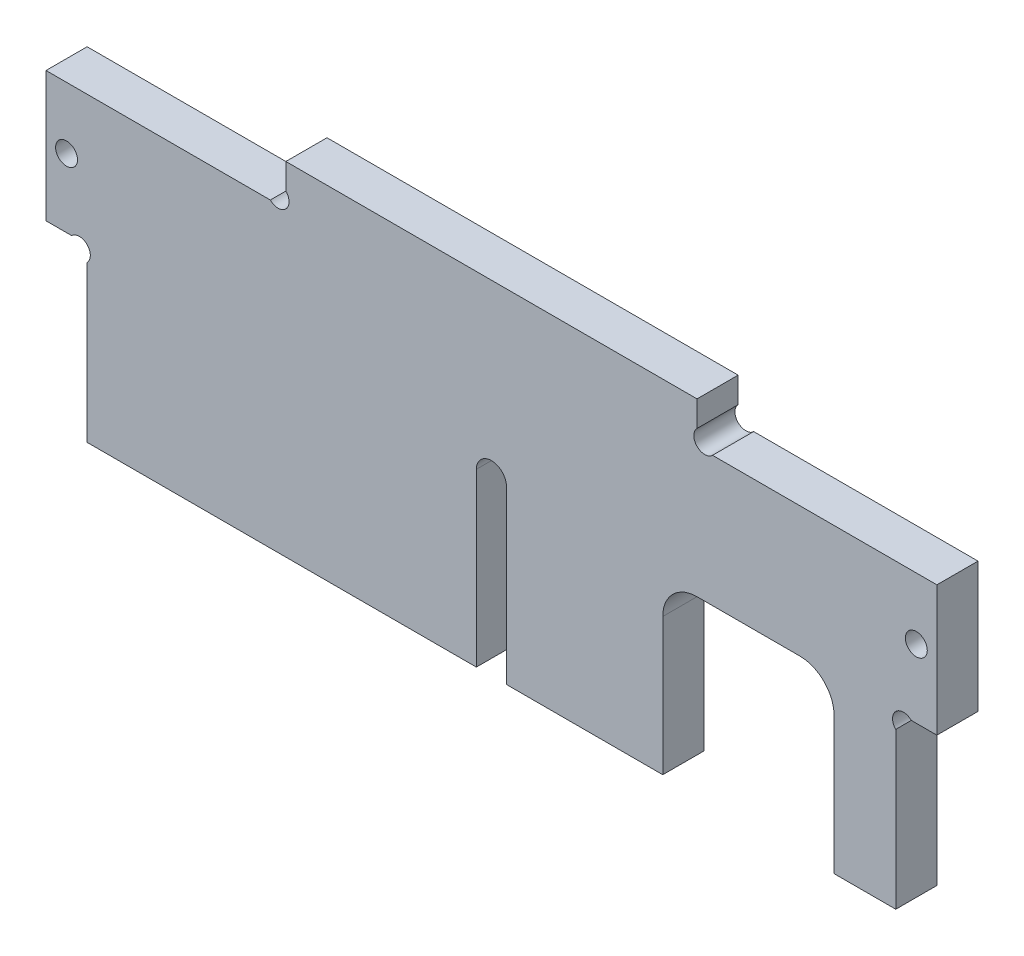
ISO-10303-21;
HEADER;
FILE_DESCRIPTION(('STEP AP214'),'2;1');
FILE_NAME('part.step','',(''),(''),'','','');
FILE_SCHEMA(('AUTOMOTIVE_DESIGN { 1 0 10303 214 1 1 1 1 }'));
ENDSEC;
DATA;
#1=APPLICATION_CONTEXT('core data for automotive mechanical design processes');
#2=APPLICATION_PROTOCOL_DEFINITION('international standard','automotive_design',2000,#1);
#3=PRODUCT_CONTEXT('',#1,'mechanical');
#4=PRODUCT('Part','Part','',(#3));
#5=PRODUCT_RELATED_PRODUCT_CATEGORY('part','',(#4));
#6=PRODUCT_DEFINITION_FORMATION('','',#4);
#7=PRODUCT_DEFINITION_CONTEXT('part definition',#1,'design');
#8=PRODUCT_DEFINITION('design','',#6,#7);
#9=PRODUCT_DEFINITION_SHAPE('','',#8);
#10=(LENGTH_UNIT() NAMED_UNIT(*) SI_UNIT(.MILLI.,.METRE.));
#11=(NAMED_UNIT(*) PLANE_ANGLE_UNIT() SI_UNIT($,.RADIAN.));
#12=(NAMED_UNIT(*) SI_UNIT($,.STERADIAN.) SOLID_ANGLE_UNIT());
#13=UNCERTAINTY_MEASURE_WITH_UNIT(LENGTH_MEASURE(1.E-05),#10,'distance_accuracy_value','');
#14=(GEOMETRIC_REPRESENTATION_CONTEXT(3) GLOBAL_UNCERTAINTY_ASSIGNED_CONTEXT((#13)) GLOBAL_UNIT_ASSIGNED_CONTEXT((#10,
#11,#12)) REPRESENTATION_CONTEXT('',''));
#15=CARTESIAN_POINT('',(0.,0.,0.));
#16=DIRECTION('',(0.,0.,1.));
#17=DIRECTION('',(1.,0.,0.));
#18=AXIS2_PLACEMENT_3D('',#15,#16,#17);
#19=CARTESIAN_POINT('',(31.1313708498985,45.1313708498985,6.));
#20=DIRECTION('',(0.,0.,1.));
#21=DIRECTION('',(1.,0.,0.));
#22=AXIS2_PLACEMENT_3D('',#19,#20,#21);
#23=PLANE('',#22);
#24=CARTESIAN_POINT('',(62.,35.,6.));
#25=DIRECTION('',(0.,0.,1.));
#26=DIRECTION('',(1.,0.,0.));
#27=AXIS2_PLACEMENT_3D('',#24,#25,#26);
#28=CIRCLE('',#27,1.60000000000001);
#29=CARTESIAN_POINT('',(63.6,35.,6.));
#30=VERTEX_POINT('',#29);
#31=EDGE_CURVE('E246',#30,#30,#28,.T.);
#32=ORIENTED_EDGE('',*,*,#31,.F.);
#33=EDGE_LOOP('',(#32));
#34=FACE_BOUND('',#33,.T.);
#35=CARTESIAN_POINT('',(31.1313708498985,45.1313708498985,6.));
#36=DIRECTION('',(0.,0.,-1.));
#37=DIRECTION('',(1.,0.,0.));
#38=AXIS2_PLACEMENT_3D('',#35,#36,#37);
#39=CIRCLE('',#38,1.6);
#40=CARTESIAN_POINT('',(32.2627416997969,44.,6.));
#41=VERTEX_POINT('',#40);
#42=CARTESIAN_POINT('',(30.,46.262741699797,6.));
#43=VERTEX_POINT('',#42);
#44=EDGE_CURVE('E293',#41,#43,#39,.T.);
#45=ORIENTED_EDGE('',*,*,#44,.T.);
#46=DIRECTION('',(0.,1.,0.));
#47=VECTOR('',#46,1.);
#48=CARTESIAN_POINT('',(30.,46.262741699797,6.));
#49=LINE('',#48,#47);
#50=CARTESIAN_POINT('',(30.,50.,6.));
#51=VERTEX_POINT('',#50);
#52=EDGE_CURVE('E151',#43,#51,#49,.T.);
#53=ORIENTED_EDGE('',*,*,#52,.T.);
#54=DIRECTION('',(-1.,0.,0.));
#55=VECTOR('',#54,1.);
#56=CARTESIAN_POINT('',(-30.,50.,6.));
#57=LINE('',#56,#55);
#58=CARTESIAN_POINT('',(-30.,50.,6.));
#59=VERTEX_POINT('',#58);
#60=EDGE_CURVE('E362',#51,#59,#57,.T.);
#61=ORIENTED_EDGE('',*,*,#60,.T.);
#62=DIRECTION('',(0.,-1.,0.));
#63=VECTOR('',#62,1.);
#64=CARTESIAN_POINT('',(-30.,46.2627416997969,6.));
#65=LINE('',#64,#63);
#66=CARTESIAN_POINT('',(-30.,46.2627416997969,6.));
#67=VERTEX_POINT('',#66);
#68=EDGE_CURVE('E381',#59,#67,#65,.T.);
#69=ORIENTED_EDGE('',*,*,#68,.T.);
#70=CARTESIAN_POINT('',(-31.1313708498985,45.1313708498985,6.));
#71=DIRECTION('',(0.,0.,-1.));
#72=DIRECTION('',(-1.,0.,0.));
#73=AXIS2_PLACEMENT_3D('',#70,#71,#72);
#74=CIRCLE('',#73,1.59999999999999);
#75=CARTESIAN_POINT('',(-32.2627416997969,44.,6.));
#76=VERTEX_POINT('',#75);
#77=EDGE_CURVE('E378',#67,#76,#74,.T.);
#78=ORIENTED_EDGE('',*,*,#77,.T.);
#79=DIRECTION('',(-1.,0.,0.));
#80=VECTOR('',#79,1.);
#81=CARTESIAN_POINT('',(-32.2627416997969,44.,6.));
#82=LINE('',#81,#80);
#83=CARTESIAN_POINT('',(-65.,44.,6.));
#84=VERTEX_POINT('',#83);
#85=EDGE_CURVE('E380',#76,#84,#82,.T.);
#86=ORIENTED_EDGE('',*,*,#85,.T.);
#87=DIRECTION('',(0.,-1.,0.));
#88=VECTOR('',#87,1.);
#89=CARTESIAN_POINT('',(-65.,44.,6.));
#90=LINE('',#89,#88);
#91=CARTESIAN_POINT('',(-65.,25.,6.));
#92=VERTEX_POINT('',#91);
#93=EDGE_CURVE('E383',#84,#92,#90,.T.);
#94=ORIENTED_EDGE('',*,*,#93,.T.);
#95=DIRECTION('',(1.,0.,0.));
#96=VECTOR('',#95,1.);
#97=CARTESIAN_POINT('',(-65.,25.,6.));
#98=LINE('',#97,#96);
#99=CARTESIAN_POINT('',(-61.262741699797,25.,6.));
#100=VERTEX_POINT('',#99);
#101=EDGE_CURVE('E389',#92,#100,#98,.T.);
#102=ORIENTED_EDGE('',*,*,#101,.T.);
#103=CARTESIAN_POINT('',(-60.1313708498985,23.8686291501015,6.));
#104=DIRECTION('',(0.,0.,-1.));
#105=DIRECTION('',(-1.,0.,0.));
#106=AXIS2_PLACEMENT_3D('',#103,#104,#105);
#107=CIRCLE('',#106,1.60000000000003);
#108=CARTESIAN_POINT('',(-59.,22.737258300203,6.));
#109=VERTEX_POINT('',#108);
#110=EDGE_CURVE('E391',#100,#109,#107,.T.);
#111=ORIENTED_EDGE('',*,*,#110,.T.);
#112=DIRECTION('',(0.,-1.,0.));
#113=VECTOR('',#112,1.);
#114=CARTESIAN_POINT('',(-59.,22.737258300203,6.));
#115=LINE('',#114,#113);
#116=CARTESIAN_POINT('',(-59.,0.,6.));
#117=VERTEX_POINT('',#116);
#118=EDGE_CURVE('E393',#109,#117,#115,.T.);
#119=ORIENTED_EDGE('',*,*,#118,.T.);
#120=DIRECTION('',(1.,0.,0.));
#121=VECTOR('',#120,1.);
#122=CARTESIAN_POINT('',(-59.,0.,6.));
#123=LINE('',#122,#121);
#124=CARTESIAN_POINT('',(-2.2,0.,6.));
#125=VERTEX_POINT('',#124);
#126=EDGE_CURVE('E395',#117,#125,#123,.T.);
#127=ORIENTED_EDGE('',*,*,#126,.T.);
#128=DIRECTION('',(0.,1.,0.));
#129=VECTOR('',#128,1.);
#130=CARTESIAN_POINT('',(-2.2,25.,6.));
#131=LINE('',#130,#129);
#132=CARTESIAN_POINT('',(-2.2,25.,6.));
#133=VERTEX_POINT('',#132);
#134=EDGE_CURVE('E397',#125,#133,#131,.T.);
#135=ORIENTED_EDGE('',*,*,#134,.T.);
#136=CARTESIAN_POINT('',(0.,25.,6.));
#137=DIRECTION('',(0.,0.,-1.));
#138=DIRECTION('',(1.,0.,0.));
#139=AXIS2_PLACEMENT_3D('',#136,#137,#138);
#140=CIRCLE('',#139,2.2);
#141=CARTESIAN_POINT('',(2.2,25.,6.));
#142=VERTEX_POINT('',#141);
#143=EDGE_CURVE('E399',#133,#142,#140,.T.);
#144=ORIENTED_EDGE('',*,*,#143,.T.);
#145=DIRECTION('',(0.,-1.,0.));
#146=VECTOR('',#145,1.);
#147=CARTESIAN_POINT('',(2.2,25.,6.));
#148=LINE('',#147,#146);
#149=CARTESIAN_POINT('',(2.2,0.,6.));
#150=VERTEX_POINT('',#149);
#151=EDGE_CURVE('E401',#142,#150,#148,.T.);
#152=ORIENTED_EDGE('',*,*,#151,.T.);
#153=DIRECTION('',(1.,0.,0.));
#154=VECTOR('',#153,1.);
#155=CARTESIAN_POINT('',(2.2,0.,6.));
#156=LINE('',#155,#154);
#157=CARTESIAN_POINT('',(25.,0.,6.));
#158=VERTEX_POINT('',#157);
#159=EDGE_CURVE('E403',#150,#158,#156,.T.);
#160=ORIENTED_EDGE('',*,*,#159,.T.);
#161=DIRECTION('',(0.,1.,0.));
#162=VECTOR('',#161,1.);
#163=CARTESIAN_POINT('',(25.,20.,6.));
#164=LINE('',#163,#162);
#165=CARTESIAN_POINT('',(25.,20.,6.));
#166=VERTEX_POINT('',#165);
#167=EDGE_CURVE('E405',#158,#166,#164,.T.);
#168=ORIENTED_EDGE('',*,*,#167,.T.);
#169=CARTESIAN_POINT('',(30.,20.,6.));
#170=DIRECTION('',(0.,0.,-1.));
#171=DIRECTION('',(1.,0.,0.));
#172=AXIS2_PLACEMENT_3D('',#169,#170,#171);
#173=CIRCLE('',#172,5.);
#174=CARTESIAN_POINT('',(30.,25.,6.));
#175=VERTEX_POINT('',#174);
#176=EDGE_CURVE('E407',#166,#175,#173,.T.);
#177=ORIENTED_EDGE('',*,*,#176,.T.);
#178=DIRECTION('',(1.,0.,0.));
#179=VECTOR('',#178,1.);
#180=CARTESIAN_POINT('',(45.,25.,6.));
#181=LINE('',#180,#179);
#182=CARTESIAN_POINT('',(45.,25.,6.));
#183=VERTEX_POINT('',#182);
#184=EDGE_CURVE('E409',#175,#183,#181,.T.);
#185=ORIENTED_EDGE('',*,*,#184,.T.);
#186=CARTESIAN_POINT('',(45.,20.,6.));
#187=DIRECTION('',(0.,0.,-1.));
#188=DIRECTION('',(1.,0.,0.));
#189=AXIS2_PLACEMENT_3D('',#186,#187,#188);
#190=CIRCLE('',#189,5.);
#191=CARTESIAN_POINT('',(50.,20.,6.));
#192=VERTEX_POINT('',#191);
#193=EDGE_CURVE('E411',#183,#192,#190,.T.);
#194=ORIENTED_EDGE('',*,*,#193,.T.);
#195=DIRECTION('',(0.,-1.,0.));
#196=VECTOR('',#195,1.);
#197=CARTESIAN_POINT('',(50.,0.,6.));
#198=LINE('',#197,#196);
#199=CARTESIAN_POINT('',(50.,0.,6.));
#200=VERTEX_POINT('',#199);
#201=EDGE_CURVE('E413',#192,#200,#198,.T.);
#202=ORIENTED_EDGE('',*,*,#201,.T.);
#203=DIRECTION('',(1.,0.,0.));
#204=VECTOR('',#203,1.);
#205=CARTESIAN_POINT('',(50.,0.,6.));
#206=LINE('',#205,#204);
#207=CARTESIAN_POINT('',(59.,0.,6.));
#208=VERTEX_POINT('',#207);
#209=EDGE_CURVE('E415',#200,#208,#206,.T.);
#210=ORIENTED_EDGE('',*,*,#209,.T.);
#211=DIRECTION('',(0.,1.,0.));
#212=VECTOR('',#211,1.);
#213=CARTESIAN_POINT('',(59.,22.737258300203,6.));
#214=LINE('',#213,#212);
#215=CARTESIAN_POINT('',(59.,22.737258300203,6.));
#216=VERTEX_POINT('',#215);
#217=EDGE_CURVE('E417',#208,#216,#214,.T.);
#218=ORIENTED_EDGE('',*,*,#217,.T.);
#219=CARTESIAN_POINT('',(60.1313708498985,23.8686291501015,6.));
#220=DIRECTION('',(0.,0.,-1.));
#221=DIRECTION('',(1.,0.,0.));
#222=AXIS2_PLACEMENT_3D('',#219,#220,#221);
#223=CIRCLE('',#222,1.60000000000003);
#224=CARTESIAN_POINT('',(61.262741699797,25.,6.));
#225=VERTEX_POINT('',#224);
#226=EDGE_CURVE('E224',#216,#225,#223,.T.);
#227=ORIENTED_EDGE('',*,*,#226,.T.);
#228=DIRECTION('',(1.,0.,0.));
#229=VECTOR('',#228,1.);
#230=CARTESIAN_POINT('',(65.,25.,6.));
#231=LINE('',#230,#229);
#232=CARTESIAN_POINT('',(65.,25.,6.));
#233=VERTEX_POINT('',#232);
#234=EDGE_CURVE('E218',#225,#233,#231,.T.);
#235=ORIENTED_EDGE('',*,*,#234,.T.);
#236=DIRECTION('',(0.,1.,0.));
#237=VECTOR('',#236,1.);
#238=CARTESIAN_POINT('',(65.,44.,6.));
#239=LINE('',#238,#237);
#240=CARTESIAN_POINT('',(65.,44.,6.));
#241=VERTEX_POINT('',#240);
#242=EDGE_CURVE('E222',#233,#241,#239,.T.);
#243=ORIENTED_EDGE('',*,*,#242,.T.);
#244=DIRECTION('',(-1.,0.,0.));
#245=VECTOR('',#244,1.);
#246=CARTESIAN_POINT('',(32.2627416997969,44.,6.));
#247=LINE('',#246,#245);
#248=EDGE_CURVE('E54',#241,#41,#247,.T.);
#249=ORIENTED_EDGE('',*,*,#248,.T.);
#250=EDGE_LOOP('',(#45,#53,#61,#69,#78,#86,#94,#102,#111,#119,#127,#135,#144,#152,#160,#168,
#177,#185,#194,#202,#210,#218,#227,#235,#243,#249));
#251=FACE_BOUND('',#250,.T.);
#252=CARTESIAN_POINT('',(-62.,35.,6.));
#253=DIRECTION('',(0.,0.,1.));
#254=DIRECTION('',(-1.,0.,0.));
#255=AXIS2_PLACEMENT_3D('',#252,#253,#254);
#256=CIRCLE('',#255,1.6);
#257=CARTESIAN_POINT('',(-63.6,35.,6.));
#258=VERTEX_POINT('',#257);
#259=EDGE_CURVE('E460',#258,#258,#256,.T.);
#260=ORIENTED_EDGE('',*,*,#259,.F.);
#261=EDGE_LOOP('',(#260));
#262=FACE_BOUND('',#261,.T.);
#263=ADVANCED_FACE('F37',(#34,#251,#262),#23,.T.);
#264=CARTESIAN_POINT('',(31.1313708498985,45.1313708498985,0.));
#265=DIRECTION('',(0.,0.,1.));
#266=DIRECTION('',(1.,0.,0.));
#267=AXIS2_PLACEMENT_3D('',#264,#265,#266);
#268=PLANE('',#267);
#269=CARTESIAN_POINT('',(62.,35.,0.));
#270=DIRECTION('',(0.,0.,1.));
#271=DIRECTION('',(1.,0.,0.));
#272=AXIS2_PLACEMENT_3D('',#269,#270,#271);
#273=CIRCLE('',#272,1.60000000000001);
#274=CARTESIAN_POINT('',(63.6,35.,0.));
#275=VERTEX_POINT('',#274);
#276=EDGE_CURVE('E465',#275,#275,#273,.T.);
#277=ORIENTED_EDGE('',*,*,#276,.T.);
#278=EDGE_LOOP('',(#277));
#279=FACE_BOUND('',#278,.T.);
#280=CARTESIAN_POINT('',(31.1313708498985,45.1313708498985,0.));
#281=DIRECTION('',(0.,0.,-1.));
#282=DIRECTION('',(1.,0.,0.));
#283=AXIS2_PLACEMENT_3D('',#280,#281,#282);
#284=CIRCLE('',#283,1.6);
#285=CARTESIAN_POINT('',(32.2627416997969,44.,0.));
#286=VERTEX_POINT('',#285);
#287=CARTESIAN_POINT('',(30.,46.262741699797,0.));
#288=VERTEX_POINT('',#287);
#289=EDGE_CURVE('E242',#286,#288,#284,.T.);
#290=ORIENTED_EDGE('',*,*,#289,.F.);
#291=DIRECTION('',(-1.,0.,0.));
#292=VECTOR('',#291,1.);
#293=CARTESIAN_POINT('',(32.2627416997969,44.,0.));
#294=LINE('',#293,#292);
#295=CARTESIAN_POINT('',(65.,44.,0.));
#296=VERTEX_POINT('',#295);
#297=EDGE_CURVE('E143',#296,#286,#294,.T.);
#298=ORIENTED_EDGE('',*,*,#297,.F.);
#299=DIRECTION('',(0.,1.,0.));
#300=VECTOR('',#299,1.);
#301=CARTESIAN_POINT('',(65.,44.,0.));
#302=LINE('',#301,#300);
#303=CARTESIAN_POINT('',(65.,25.,0.));
#304=VERTEX_POINT('',#303);
#305=EDGE_CURVE('E137',#304,#296,#302,.T.);
#306=ORIENTED_EDGE('',*,*,#305,.F.);
#307=DIRECTION('',(1.,0.,0.));
#308=VECTOR('',#307,1.);
#309=CARTESIAN_POINT('',(65.,25.,0.));
#310=LINE('',#309,#308);
#311=CARTESIAN_POINT('',(61.262741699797,25.,0.));
#312=VERTEX_POINT('',#311);
#313=EDGE_CURVE('E232',#312,#304,#310,.T.);
#314=ORIENTED_EDGE('',*,*,#313,.F.);
#315=CARTESIAN_POINT('',(60.1313708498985,23.8686291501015,0.));
#316=DIRECTION('',(0.,0.,-1.));
#317=DIRECTION('',(1.,0.,0.));
#318=AXIS2_PLACEMENT_3D('',#315,#316,#317);
#319=CIRCLE('',#318,1.60000000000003);
#320=CARTESIAN_POINT('',(59.,22.737258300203,0.));
#321=VERTEX_POINT('',#320);
#322=EDGE_CURVE('E288',#321,#312,#319,.T.);
#323=ORIENTED_EDGE('',*,*,#322,.F.);
#324=DIRECTION('',(0.,1.,0.));
#325=VECTOR('',#324,1.);
#326=CARTESIAN_POINT('',(59.,22.737258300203,0.));
#327=LINE('',#326,#325);
#328=CARTESIAN_POINT('',(59.,0.,0.));
#329=VERTEX_POINT('',#328);
#330=EDGE_CURVE('E286',#329,#321,#327,.T.);
#331=ORIENTED_EDGE('',*,*,#330,.F.);
#332=DIRECTION('',(1.,0.,0.));
#333=VECTOR('',#332,1.);
#334=CARTESIAN_POINT('',(50.,0.,0.));
#335=LINE('',#334,#333);
#336=CARTESIAN_POINT('',(50.,0.,0.));
#337=VERTEX_POINT('',#336);
#338=EDGE_CURVE('E284',#337,#329,#335,.T.);
#339=ORIENTED_EDGE('',*,*,#338,.F.);
#340=DIRECTION('',(0.,-1.,0.));
#341=VECTOR('',#340,1.);
#342=CARTESIAN_POINT('',(50.,0.,0.));
#343=LINE('',#342,#341);
#344=CARTESIAN_POINT('',(50.,20.,0.));
#345=VERTEX_POINT('',#344);
#346=EDGE_CURVE('E282',#345,#337,#343,.T.);
#347=ORIENTED_EDGE('',*,*,#346,.F.);
#348=CARTESIAN_POINT('',(45.,20.,0.));
#349=DIRECTION('',(0.,0.,-1.));
#350=DIRECTION('',(1.,0.,0.));
#351=AXIS2_PLACEMENT_3D('',#348,#349,#350);
#352=CIRCLE('',#351,5.);
#353=CARTESIAN_POINT('',(45.,25.,0.));
#354=VERTEX_POINT('',#353);
#355=EDGE_CURVE('E280',#354,#345,#352,.T.);
#356=ORIENTED_EDGE('',*,*,#355,.F.);
#357=DIRECTION('',(1.,0.,0.));
#358=VECTOR('',#357,1.);
#359=CARTESIAN_POINT('',(45.,25.,0.));
#360=LINE('',#359,#358);
#361=CARTESIAN_POINT('',(30.,25.,0.));
#362=VERTEX_POINT('',#361);
#363=EDGE_CURVE('E278',#362,#354,#360,.T.);
#364=ORIENTED_EDGE('',*,*,#363,.F.);
#365=CARTESIAN_POINT('',(30.,20.,0.));
#366=DIRECTION('',(0.,0.,-1.));
#367=DIRECTION('',(1.,0.,0.));
#368=AXIS2_PLACEMENT_3D('',#365,#366,#367);
#369=CIRCLE('',#368,5.);
#370=CARTESIAN_POINT('',(25.,20.,0.));
#371=VERTEX_POINT('',#370);
#372=EDGE_CURVE('E276',#371,#362,#369,.T.);
#373=ORIENTED_EDGE('',*,*,#372,.F.);
#374=DIRECTION('',(0.,1.,0.));
#375=VECTOR('',#374,1.);
#376=CARTESIAN_POINT('',(25.,20.,0.));
#377=LINE('',#376,#375);
#378=CARTESIAN_POINT('',(25.,0.,0.));
#379=VERTEX_POINT('',#378);
#380=EDGE_CURVE('E274',#379,#371,#377,.T.);
#381=ORIENTED_EDGE('',*,*,#380,.F.);
#382=DIRECTION('',(1.,0.,0.));
#383=VECTOR('',#382,1.);
#384=CARTESIAN_POINT('',(2.2,0.,0.));
#385=LINE('',#384,#383);
#386=CARTESIAN_POINT('',(2.2,0.,0.));
#387=VERTEX_POINT('',#386);
#388=EDGE_CURVE('E272',#387,#379,#385,.T.);
#389=ORIENTED_EDGE('',*,*,#388,.F.);
#390=DIRECTION('',(0.,-1.,0.));
#391=VECTOR('',#390,1.);
#392=CARTESIAN_POINT('',(2.2,25.,0.));
#393=LINE('',#392,#391);
#394=CARTESIAN_POINT('',(2.2,25.,0.));
#395=VERTEX_POINT('',#394);
#396=EDGE_CURVE('E270',#395,#387,#393,.T.);
#397=ORIENTED_EDGE('',*,*,#396,.F.);
#398=CARTESIAN_POINT('',(0.,25.,0.));
#399=DIRECTION('',(0.,0.,-1.));
#400=DIRECTION('',(1.,0.,0.));
#401=AXIS2_PLACEMENT_3D('',#398,#399,#400);
#402=CIRCLE('',#401,2.2);
#403=CARTESIAN_POINT('',(-2.2,25.,0.));
#404=VERTEX_POINT('',#403);
#405=EDGE_CURVE('E268',#404,#395,#402,.T.);
#406=ORIENTED_EDGE('',*,*,#405,.F.);
#407=DIRECTION('',(0.,1.,0.));
#408=VECTOR('',#407,1.);
#409=CARTESIAN_POINT('',(-2.2,25.,0.));
#410=LINE('',#409,#408);
#411=CARTESIAN_POINT('',(-2.2,0.,0.));
#412=VERTEX_POINT('',#411);
#413=EDGE_CURVE('E266',#412,#404,#410,.T.);
#414=ORIENTED_EDGE('',*,*,#413,.F.);
#415=DIRECTION('',(1.,0.,0.));
#416=VECTOR('',#415,1.);
#417=CARTESIAN_POINT('',(-59.,0.,0.));
#418=LINE('',#417,#416);
#419=CARTESIAN_POINT('',(-59.,0.,0.));
#420=VERTEX_POINT('',#419);
#421=EDGE_CURVE('E264',#420,#412,#418,.T.);
#422=ORIENTED_EDGE('',*,*,#421,.F.);
#423=DIRECTION('',(0.,-1.,0.));
#424=VECTOR('',#423,1.);
#425=CARTESIAN_POINT('',(-59.,22.737258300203,0.));
#426=LINE('',#425,#424);
#427=CARTESIAN_POINT('',(-59.,22.737258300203,0.));
#428=VERTEX_POINT('',#427);
#429=EDGE_CURVE('E262',#428,#420,#426,.T.);
#430=ORIENTED_EDGE('',*,*,#429,.F.);
#431=CARTESIAN_POINT('',(-60.1313708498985,23.8686291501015,0.));
#432=DIRECTION('',(0.,0.,-1.));
#433=DIRECTION('',(-1.,0.,0.));
#434=AXIS2_PLACEMENT_3D('',#431,#432,#433);
#435=CIRCLE('',#434,1.60000000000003);
#436=CARTESIAN_POINT('',(-61.262741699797,25.,0.));
#437=VERTEX_POINT('',#436);
#438=EDGE_CURVE('E260',#437,#428,#435,.T.);
#439=ORIENTED_EDGE('',*,*,#438,.F.);
#440=DIRECTION('',(1.,0.,0.));
#441=VECTOR('',#440,1.);
#442=CARTESIAN_POINT('',(-65.,25.,0.));
#443=LINE('',#442,#441);
#444=CARTESIAN_POINT('',(-65.,25.,0.));
#445=VERTEX_POINT('',#444);
#446=EDGE_CURVE('E258',#445,#437,#443,.T.);
#447=ORIENTED_EDGE('',*,*,#446,.F.);
#448=DIRECTION('',(0.,-1.,0.));
#449=VECTOR('',#448,1.);
#450=CARTESIAN_POINT('',(-65.,44.,0.));
#451=LINE('',#450,#449);
#452=CARTESIAN_POINT('',(-65.,44.,0.));
#453=VERTEX_POINT('',#452);
#454=EDGE_CURVE('E256',#453,#445,#451,.T.);
#455=ORIENTED_EDGE('',*,*,#454,.F.);
#456=DIRECTION('',(-1.,0.,0.));
#457=VECTOR('',#456,1.);
#458=CARTESIAN_POINT('',(-32.2627416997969,44.,0.));
#459=LINE('',#458,#457);
#460=CARTESIAN_POINT('',(-32.2627416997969,44.,0.));
#461=VERTEX_POINT('',#460);
#462=EDGE_CURVE('E254',#461,#453,#459,.T.);
#463=ORIENTED_EDGE('',*,*,#462,.F.);
#464=CARTESIAN_POINT('',(-31.1313708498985,45.1313708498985,0.));
#465=DIRECTION('',(0.,0.,-1.));
#466=DIRECTION('',(-1.,0.,0.));
#467=AXIS2_PLACEMENT_3D('',#464,#465,#466);
#468=CIRCLE('',#467,1.59999999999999);
#469=CARTESIAN_POINT('',(-30.,46.2627416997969,0.));
#470=VERTEX_POINT('',#469);
#471=EDGE_CURVE('E252',#470,#461,#468,.T.);
#472=ORIENTED_EDGE('',*,*,#471,.F.);
#473=DIRECTION('',(0.,-1.,0.));
#474=VECTOR('',#473,1.);
#475=CARTESIAN_POINT('',(-30.,46.2627416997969,0.));
#476=LINE('',#475,#474);
#477=CARTESIAN_POINT('',(-30.,50.,0.));
#478=VERTEX_POINT('',#477);
#479=EDGE_CURVE('E250',#478,#470,#476,.T.);
#480=ORIENTED_EDGE('',*,*,#479,.F.);
#481=DIRECTION('',(-1.,0.,0.));
#482=VECTOR('',#481,1.);
#483=CARTESIAN_POINT('',(-30.,50.,0.));
#484=LINE('',#483,#482);
#485=CARTESIAN_POINT('',(30.,50.,0.));
#486=VERTEX_POINT('',#485);
#487=EDGE_CURVE('E248',#486,#478,#484,.T.);
#488=ORIENTED_EDGE('',*,*,#487,.F.);
#489=DIRECTION('',(0.,1.,0.));
#490=VECTOR('',#489,1.);
#491=CARTESIAN_POINT('',(30.,46.262741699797,0.));
#492=LINE('',#491,#490);
#493=EDGE_CURVE('E245',#288,#486,#492,.T.);
#494=ORIENTED_EDGE('',*,*,#493,.F.);
#495=EDGE_LOOP('',(#290,#298,#306,#314,#323,#331,#339,#347,#356,#364,#373,#381,#389,#397,#406,
#414,#422,#430,#439,#447,#455,#463,#472,#480,#488,#494));
#496=FACE_BOUND('',#495,.T.);
#497=CARTESIAN_POINT('',(-62.,35.,0.));
#498=DIRECTION('',(0.,0.,1.));
#499=DIRECTION('',(-1.,0.,0.));
#500=AXIS2_PLACEMENT_3D('',#497,#498,#499);
#501=CIRCLE('',#500,1.6);
#502=CARTESIAN_POINT('',(-63.6,35.,0.));
#503=VERTEX_POINT('',#502);
#504=EDGE_CURVE('E463',#503,#503,#501,.T.);
#505=ORIENTED_EDGE('',*,*,#504,.T.);
#506=EDGE_LOOP('',(#505));
#507=FACE_BOUND('',#506,.T.);
#508=ADVANCED_FACE('F366',(#279,#496,#507),#268,.F.);
#509=CARTESIAN_POINT('',(31.1313708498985,45.1313708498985,6.));
#510=DIRECTION('',(0.,0.,-1.));
#511=DIRECTION('',(-1.,0.,0.));
#512=AXIS2_PLACEMENT_3D('',#509,#510,#511);
#513=CYLINDRICAL_SURFACE('',#512,1.6);
#514=ORIENTED_EDGE('',*,*,#289,.T.);
#515=DIRECTION('',(0.,0.,-1.));
#516=VECTOR('',#515,1.);
#517=CARTESIAN_POINT('',(30.,46.262741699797,6.));
#518=LINE('',#517,#516);
#519=EDGE_CURVE('E11',#43,#288,#518,.T.);
#520=ORIENTED_EDGE('',*,*,#519,.F.);
#521=ORIENTED_EDGE('',*,*,#44,.F.);
#522=DIRECTION('',(0.,0.,-1.));
#523=VECTOR('',#522,1.);
#524=CARTESIAN_POINT('',(32.2627416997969,44.,6.));
#525=LINE('',#524,#523);
#526=EDGE_CURVE('E238',#41,#286,#525,.T.);
#527=ORIENTED_EDGE('',*,*,#526,.T.);
#528=EDGE_LOOP('',(#514,#520,#521,#527));
#529=FACE_BOUND('',#528,.T.);
#530=ADVANCED_FACE('F39',(#529),#513,.F.);
#531=CARTESIAN_POINT('',(30.,46.262741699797,6.));
#532=DIRECTION('',(-1.,0.,0.));
#533=DIRECTION('',(0.,-1.,0.));
#534=AXIS2_PLACEMENT_3D('',#531,#532,#533);
#535=PLANE('',#534);
#536=ORIENTED_EDGE('',*,*,#493,.T.);
#537=DIRECTION('',(0.,0.,-1.));
#538=VECTOR('',#537,1.);
#539=CARTESIAN_POINT('',(30.,50.,6.));
#540=LINE('',#539,#538);
#541=EDGE_CURVE('E46',#51,#486,#540,.T.);
#542=ORIENTED_EDGE('',*,*,#541,.F.);
#543=ORIENTED_EDGE('',*,*,#52,.F.);
#544=ORIENTED_EDGE('',*,*,#519,.T.);
#545=EDGE_LOOP('',(#536,#542,#543,#544));
#546=FACE_BOUND('',#545,.T.);
#547=ADVANCED_FACE('F698',(#546),#535,.F.);
#548=CARTESIAN_POINT('',(-30.,50.,6.));
#549=DIRECTION('',(0.,-1.,0.));
#550=DIRECTION('',(0.,0.,-1.));
#551=AXIS2_PLACEMENT_3D('',#548,#549,#550);
#552=PLANE('',#551);
#553=ORIENTED_EDGE('',*,*,#487,.T.);
#554=DIRECTION('',(0.,0.,-1.));
#555=VECTOR('',#554,1.);
#556=CARTESIAN_POINT('',(-30.,50.,6.));
#557=LINE('',#556,#555);
#558=EDGE_CURVE('E354',#59,#478,#557,.T.);
#559=ORIENTED_EDGE('',*,*,#558,.F.);
#560=ORIENTED_EDGE('',*,*,#60,.F.);
#561=ORIENTED_EDGE('',*,*,#541,.T.);
#562=EDGE_LOOP('',(#553,#559,#560,#561));
#563=FACE_BOUND('',#562,.T.);
#564=ADVANCED_FACE('F360',(#563),#552,.F.);
#565=CARTESIAN_POINT('',(-30.,46.2627416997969,6.));
#566=DIRECTION('',(1.,0.,0.));
#567=DIRECTION('',(0.,1.,0.));
#568=AXIS2_PLACEMENT_3D('',#565,#566,#567);
#569=PLANE('',#568);
#570=ORIENTED_EDGE('',*,*,#479,.T.);
#571=DIRECTION('',(0.,0.,-1.));
#572=VECTOR('',#571,1.);
#573=CARTESIAN_POINT('',(-30.,46.2627416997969,6.));
#574=LINE('',#573,#572);
#575=EDGE_CURVE('E351',#67,#470,#574,.T.);
#576=ORIENTED_EDGE('',*,*,#575,.F.);
#577=ORIENTED_EDGE('',*,*,#68,.F.);
#578=ORIENTED_EDGE('',*,*,#558,.T.);
#579=EDGE_LOOP('',(#570,#576,#577,#578));
#580=FACE_BOUND('',#579,.T.);
#581=ADVANCED_FACE('F372',(#580),#569,.F.);
#582=CARTESIAN_POINT('',(-31.1313708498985,45.1313708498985,6.));
#583=DIRECTION('',(0.,0.,-1.));
#584=DIRECTION('',(-1.,0.,0.));
#585=AXIS2_PLACEMENT_3D('',#582,#583,#584);
#586=CYLINDRICAL_SURFACE('',#585,1.59999999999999);
#587=ORIENTED_EDGE('',*,*,#471,.T.);
#588=DIRECTION('',(0.,0.,-1.));
#589=VECTOR('',#588,1.);
#590=CARTESIAN_POINT('',(-32.2627416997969,44.,6.));
#591=LINE('',#590,#589);
#592=EDGE_CURVE('E348',#76,#461,#591,.T.);
#593=ORIENTED_EDGE('',*,*,#592,.F.);
#594=ORIENTED_EDGE('',*,*,#77,.F.);
#595=ORIENTED_EDGE('',*,*,#575,.T.);
#596=EDGE_LOOP('',(#587,#593,#594,#595));
#597=FACE_BOUND('',#596,.T.);
#598=ADVANCED_FACE('F376',(#597),#586,.F.);
#599=CARTESIAN_POINT('',(-32.2627416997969,44.,6.));
#600=DIRECTION('',(0.,-1.,0.));
#601=DIRECTION('',(1.,0.,0.));
#602=AXIS2_PLACEMENT_3D('',#599,#600,#601);
#603=PLANE('',#602);
#604=ORIENTED_EDGE('',*,*,#462,.T.);
#605=DIRECTION('',(0.,0.,-1.));
#606=VECTOR('',#605,1.);
#607=CARTESIAN_POINT('',(-65.,44.,6.));
#608=LINE('',#607,#606);
#609=EDGE_CURVE('E345',#84,#453,#608,.T.);
#610=ORIENTED_EDGE('',*,*,#609,.F.);
#611=ORIENTED_EDGE('',*,*,#85,.F.);
#612=ORIENTED_EDGE('',*,*,#592,.T.);
#613=EDGE_LOOP('',(#604,#610,#611,#612));
#614=FACE_BOUND('',#613,.T.);
#615=ADVANCED_FACE('F663',(#614),#603,.F.);
#616=CARTESIAN_POINT('',(-65.,44.,6.));
#617=DIRECTION('',(1.,0.,0.));
#618=DIRECTION('',(0.,0.,-1.));
#619=AXIS2_PLACEMENT_3D('',#616,#617,#618);
#620=PLANE('',#619);
#621=ORIENTED_EDGE('',*,*,#454,.T.);
#622=DIRECTION('',(0.,0.,-1.));
#623=VECTOR('',#622,1.);
#624=CARTESIAN_POINT('',(-65.,25.,6.));
#625=LINE('',#624,#623);
#626=EDGE_CURVE('E342',#92,#445,#625,.T.);
#627=ORIENTED_EDGE('',*,*,#626,.F.);
#628=ORIENTED_EDGE('',*,*,#93,.F.);
#629=ORIENTED_EDGE('',*,*,#609,.T.);
#630=EDGE_LOOP('',(#621,#627,#628,#629));
#631=FACE_BOUND('',#630,.T.);
#632=ADVANCED_FACE('F653',(#631),#620,.F.);
#633=CARTESIAN_POINT('',(-65.,25.,6.));
#634=DIRECTION('',(0.,1.,0.));
#635=DIRECTION('',(-1.,0.,0.));
#636=AXIS2_PLACEMENT_3D('',#633,#634,#635);
#637=PLANE('',#636);
#638=ORIENTED_EDGE('',*,*,#446,.T.);
#639=DIRECTION('',(0.,0.,-1.));
#640=VECTOR('',#639,1.);
#641=CARTESIAN_POINT('',(-61.262741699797,25.,6.));
#642=LINE('',#641,#640);
#643=EDGE_CURVE('E339',#100,#437,#642,.T.);
#644=ORIENTED_EDGE('',*,*,#643,.F.);
#645=ORIENTED_EDGE('',*,*,#101,.F.);
#646=ORIENTED_EDGE('',*,*,#626,.T.);
#647=EDGE_LOOP('',(#638,#644,#645,#646));
#648=FACE_BOUND('',#647,.T.);
#649=ADVANCED_FACE('F643',(#648),#637,.F.);
#650=CARTESIAN_POINT('',(-60.1313708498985,23.8686291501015,6.));
#651=DIRECTION('',(0.,0.,-1.));
#652=DIRECTION('',(-1.,0.,0.));
#653=AXIS2_PLACEMENT_3D('',#650,#651,#652);
#654=CYLINDRICAL_SURFACE('',#653,1.60000000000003);
#655=ORIENTED_EDGE('',*,*,#438,.T.);
#656=DIRECTION('',(0.,0.,-1.));
#657=VECTOR('',#656,1.);
#658=CARTESIAN_POINT('',(-59.,22.737258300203,6.));
#659=LINE('',#658,#657);
#660=EDGE_CURVE('E336',#109,#428,#659,.T.);
#661=ORIENTED_EDGE('',*,*,#660,.F.);
#662=ORIENTED_EDGE('',*,*,#110,.F.);
#663=ORIENTED_EDGE('',*,*,#643,.T.);
#664=EDGE_LOOP('',(#655,#661,#662,#663));
#665=FACE_BOUND('',#664,.T.);
#666=ADVANCED_FACE('F633',(#665),#654,.F.);
#667=CARTESIAN_POINT('',(-59.,22.737258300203,6.));
#668=DIRECTION('',(1.,0.,0.));
#669=DIRECTION('',(0.,0.,-1.));
#670=AXIS2_PLACEMENT_3D('',#667,#668,#669);
#671=PLANE('',#670);
#672=ORIENTED_EDGE('',*,*,#429,.T.);
#673=DIRECTION('',(0.,0.,-1.));
#674=VECTOR('',#673,1.);
#675=CARTESIAN_POINT('',(-59.,0.,6.));
#676=LINE('',#675,#674);
#677=EDGE_CURVE('E333',#117,#420,#676,.T.);
#678=ORIENTED_EDGE('',*,*,#677,.F.);
#679=ORIENTED_EDGE('',*,*,#118,.F.);
#680=ORIENTED_EDGE('',*,*,#660,.T.);
#681=EDGE_LOOP('',(#672,#678,#679,#680));
#682=FACE_BOUND('',#681,.T.);
#683=ADVANCED_FACE('F623',(#682),#671,.F.);
#684=CARTESIAN_POINT('',(-59.,0.,6.));
#685=DIRECTION('',(0.,1.,0.));
#686=DIRECTION('',(0.,0.,1.));
#687=AXIS2_PLACEMENT_3D('',#684,#685,#686);
#688=PLANE('',#687);
#689=ORIENTED_EDGE('',*,*,#421,.T.);
#690=DIRECTION('',(0.,0.,-1.));
#691=VECTOR('',#690,1.);
#692=CARTESIAN_POINT('',(-2.2,0.,6.));
#693=LINE('',#692,#691);
#694=EDGE_CURVE('E330',#125,#412,#693,.T.);
#695=ORIENTED_EDGE('',*,*,#694,.F.);
#696=ORIENTED_EDGE('',*,*,#126,.F.);
#697=ORIENTED_EDGE('',*,*,#677,.T.);
#698=EDGE_LOOP('',(#689,#695,#696,#697));
#699=FACE_BOUND('',#698,.T.);
#700=ADVANCED_FACE('F613',(#699),#688,.F.);
#701=CARTESIAN_POINT('',(-2.2,25.,6.));
#702=DIRECTION('',(-1.,0.,0.));
#703=DIRECTION('',(0.,0.,1.));
#704=AXIS2_PLACEMENT_3D('',#701,#702,#703);
#705=PLANE('',#704);
#706=ORIENTED_EDGE('',*,*,#413,.T.);
#707=DIRECTION('',(0.,0.,-1.));
#708=VECTOR('',#707,1.);
#709=CARTESIAN_POINT('',(-2.2,25.,6.));
#710=LINE('',#709,#708);
#711=EDGE_CURVE('E327',#133,#404,#710,.T.);
#712=ORIENTED_EDGE('',*,*,#711,.F.);
#713=ORIENTED_EDGE('',*,*,#134,.F.);
#714=ORIENTED_EDGE('',*,*,#694,.T.);
#715=EDGE_LOOP('',(#706,#712,#713,#714));
#716=FACE_BOUND('',#715,.T.);
#717=ADVANCED_FACE('F603',(#716),#705,.F.);
#718=CARTESIAN_POINT('',(0.,25.,6.));
#719=DIRECTION('',(0.,0.,-1.));
#720=DIRECTION('',(-1.,0.,0.));
#721=AXIS2_PLACEMENT_3D('',#718,#719,#720);
#722=CYLINDRICAL_SURFACE('',#721,2.2);
#723=ORIENTED_EDGE('',*,*,#405,.T.);
#724=DIRECTION('',(0.,0.,-1.));
#725=VECTOR('',#724,1.);
#726=CARTESIAN_POINT('',(2.2,25.,6.));
#727=LINE('',#726,#725);
#728=EDGE_CURVE('E324',#142,#395,#727,.T.);
#729=ORIENTED_EDGE('',*,*,#728,.F.);
#730=ORIENTED_EDGE('',*,*,#143,.F.);
#731=ORIENTED_EDGE('',*,*,#711,.T.);
#732=EDGE_LOOP('',(#723,#729,#730,#731));
#733=FACE_BOUND('',#732,.T.);
#734=ADVANCED_FACE('F593',(#733),#722,.F.);
#735=CARTESIAN_POINT('',(2.2,25.,6.));
#736=DIRECTION('',(1.,0.,0.));
#737=DIRECTION('',(0.,1.,0.));
#738=AXIS2_PLACEMENT_3D('',#735,#736,#737);
#739=PLANE('',#738);
#740=ORIENTED_EDGE('',*,*,#396,.T.);
#741=DIRECTION('',(0.,0.,-1.));
#742=VECTOR('',#741,1.);
#743=CARTESIAN_POINT('',(2.2,0.,6.));
#744=LINE('',#743,#742);
#745=EDGE_CURVE('E321',#150,#387,#744,.T.);
#746=ORIENTED_EDGE('',*,*,#745,.F.);
#747=ORIENTED_EDGE('',*,*,#151,.F.);
#748=ORIENTED_EDGE('',*,*,#728,.T.);
#749=EDGE_LOOP('',(#740,#746,#747,#748));
#750=FACE_BOUND('',#749,.T.);
#751=ADVANCED_FACE('F583',(#750),#739,.F.);
#752=CARTESIAN_POINT('',(2.2,0.,6.));
#753=DIRECTION('',(0.,1.,0.));
#754=DIRECTION('',(-1.,0.,0.));
#755=AXIS2_PLACEMENT_3D('',#752,#753,#754);
#756=PLANE('',#755);
#757=ORIENTED_EDGE('',*,*,#388,.T.);
#758=DIRECTION('',(0.,0.,-1.));
#759=VECTOR('',#758,1.);
#760=CARTESIAN_POINT('',(25.,0.,6.));
#761=LINE('',#760,#759);
#762=EDGE_CURVE('E318',#158,#379,#761,.T.);
#763=ORIENTED_EDGE('',*,*,#762,.F.);
#764=ORIENTED_EDGE('',*,*,#159,.F.);
#765=ORIENTED_EDGE('',*,*,#745,.T.);
#766=EDGE_LOOP('',(#757,#763,#764,#765));
#767=FACE_BOUND('',#766,.T.);
#768=ADVANCED_FACE('F573',(#767),#756,.F.);
#769=CARTESIAN_POINT('',(25.,20.,6.));
#770=DIRECTION('',(-1.,0.,0.));
#771=DIRECTION('',(0.,-1.,0.));
#772=AXIS2_PLACEMENT_3D('',#769,#770,#771);
#773=PLANE('',#772);
#774=ORIENTED_EDGE('',*,*,#380,.T.);
#775=DIRECTION('',(0.,0.,-1.));
#776=VECTOR('',#775,1.);
#777=CARTESIAN_POINT('',(25.,20.,6.));
#778=LINE('',#777,#776);
#779=EDGE_CURVE('E315',#166,#371,#778,.T.);
#780=ORIENTED_EDGE('',*,*,#779,.F.);
#781=ORIENTED_EDGE('',*,*,#167,.F.);
#782=ORIENTED_EDGE('',*,*,#762,.T.);
#783=EDGE_LOOP('',(#774,#780,#781,#782));
#784=FACE_BOUND('',#783,.T.);
#785=ADVANCED_FACE('F563',(#784),#773,.F.);
#786=CARTESIAN_POINT('',(30.,20.,6.));
#787=DIRECTION('',(0.,0.,-1.));
#788=DIRECTION('',(-1.,0.,0.));
#789=AXIS2_PLACEMENT_3D('',#786,#787,#788);
#790=CYLINDRICAL_SURFACE('',#789,5.);
#791=ORIENTED_EDGE('',*,*,#372,.T.);
#792=DIRECTION('',(0.,0.,-1.));
#793=VECTOR('',#792,1.);
#794=CARTESIAN_POINT('',(30.,25.,6.));
#795=LINE('',#794,#793);
#796=EDGE_CURVE('E312',#175,#362,#795,.T.);
#797=ORIENTED_EDGE('',*,*,#796,.F.);
#798=ORIENTED_EDGE('',*,*,#176,.F.);
#799=ORIENTED_EDGE('',*,*,#779,.T.);
#800=EDGE_LOOP('',(#791,#797,#798,#799));
#801=FACE_BOUND('',#800,.T.);
#802=ADVANCED_FACE('F553',(#801),#790,.F.);
#803=CARTESIAN_POINT('',(45.,25.,6.));
#804=DIRECTION('',(0.,1.,0.));
#805=DIRECTION('',(0.,0.,1.));
#806=AXIS2_PLACEMENT_3D('',#803,#804,#805);
#807=PLANE('',#806);
#808=ORIENTED_EDGE('',*,*,#363,.T.);
#809=DIRECTION('',(0.,0.,-1.));
#810=VECTOR('',#809,1.);
#811=CARTESIAN_POINT('',(45.,25.,6.));
#812=LINE('',#811,#810);
#813=EDGE_CURVE('E309',#183,#354,#812,.T.);
#814=ORIENTED_EDGE('',*,*,#813,.F.);
#815=ORIENTED_EDGE('',*,*,#184,.F.);
#816=ORIENTED_EDGE('',*,*,#796,.T.);
#817=EDGE_LOOP('',(#808,#814,#815,#816));
#818=FACE_BOUND('',#817,.T.);
#819=ADVANCED_FACE('F543',(#818),#807,.F.);
#820=CARTESIAN_POINT('',(45.,20.,6.));
#821=DIRECTION('',(0.,0.,-1.));
#822=DIRECTION('',(-1.,0.,0.));
#823=AXIS2_PLACEMENT_3D('',#820,#821,#822);
#824=CYLINDRICAL_SURFACE('',#823,5.);
#825=ORIENTED_EDGE('',*,*,#355,.T.);
#826=DIRECTION('',(0.,0.,-1.));
#827=VECTOR('',#826,1.);
#828=CARTESIAN_POINT('',(50.,20.,6.));
#829=LINE('',#828,#827);
#830=EDGE_CURVE('E306',#192,#345,#829,.T.);
#831=ORIENTED_EDGE('',*,*,#830,.F.);
#832=ORIENTED_EDGE('',*,*,#193,.F.);
#833=ORIENTED_EDGE('',*,*,#813,.T.);
#834=EDGE_LOOP('',(#825,#831,#832,#833));
#835=FACE_BOUND('',#834,.T.);
#836=ADVANCED_FACE('F533',(#835),#824,.F.);
#837=CARTESIAN_POINT('',(50.,0.,6.));
#838=DIRECTION('',(1.,0.,0.));
#839=DIRECTION('',(0.,1.,0.));
#840=AXIS2_PLACEMENT_3D('',#837,#838,#839);
#841=PLANE('',#840);
#842=ORIENTED_EDGE('',*,*,#346,.T.);
#843=DIRECTION('',(0.,0.,-1.));
#844=VECTOR('',#843,1.);
#845=CARTESIAN_POINT('',(50.,0.,6.));
#846=LINE('',#845,#844);
#847=EDGE_CURVE('E303',#200,#337,#846,.T.);
#848=ORIENTED_EDGE('',*,*,#847,.F.);
#849=ORIENTED_EDGE('',*,*,#201,.F.);
#850=ORIENTED_EDGE('',*,*,#830,.T.);
#851=EDGE_LOOP('',(#842,#848,#849,#850));
#852=FACE_BOUND('',#851,.T.);
#853=ADVANCED_FACE('F523',(#852),#841,.F.);
#854=CARTESIAN_POINT('',(50.,0.,6.));
#855=DIRECTION('',(0.,1.,0.));
#856=DIRECTION('',(-1.,0.,0.));
#857=AXIS2_PLACEMENT_3D('',#854,#855,#856);
#858=PLANE('',#857);
#859=ORIENTED_EDGE('',*,*,#338,.T.);
#860=DIRECTION('',(0.,0.,-1.));
#861=VECTOR('',#860,1.);
#862=CARTESIAN_POINT('',(59.,0.,6.));
#863=LINE('',#862,#861);
#864=EDGE_CURVE('E300',#208,#329,#863,.T.);
#865=ORIENTED_EDGE('',*,*,#864,.F.);
#866=ORIENTED_EDGE('',*,*,#209,.F.);
#867=ORIENTED_EDGE('',*,*,#847,.T.);
#868=EDGE_LOOP('',(#859,#865,#866,#867));
#869=FACE_BOUND('',#868,.T.);
#870=ADVANCED_FACE('F514',(#869),#858,.F.);
#871=CARTESIAN_POINT('',(59.,22.737258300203,6.));
#872=DIRECTION('',(-1.,0.,0.));
#873=DIRECTION('',(0.,0.,1.));
#874=AXIS2_PLACEMENT_3D('',#871,#872,#873);
#875=PLANE('',#874);
#876=ORIENTED_EDGE('',*,*,#330,.T.);
#877=DIRECTION('',(0.,0.,-1.));
#878=VECTOR('',#877,1.);
#879=CARTESIAN_POINT('',(59.,22.737258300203,6.));
#880=LINE('',#879,#878);
#881=EDGE_CURVE('E297',#216,#321,#880,.T.);
#882=ORIENTED_EDGE('',*,*,#881,.F.);
#883=ORIENTED_EDGE('',*,*,#217,.F.);
#884=ORIENTED_EDGE('',*,*,#864,.T.);
#885=EDGE_LOOP('',(#876,#882,#883,#884));
#886=FACE_BOUND('',#885,.T.);
#887=ADVANCED_FACE('F423',(#886),#875,.F.);
#888=CARTESIAN_POINT('',(60.1313708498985,23.8686291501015,6.));
#889=DIRECTION('',(0.,0.,-1.));
#890=DIRECTION('',(-1.,0.,0.));
#891=AXIS2_PLACEMENT_3D('',#888,#889,#890);
#892=CYLINDRICAL_SURFACE('',#891,1.60000000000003);
#893=ORIENTED_EDGE('',*,*,#322,.T.);
#894=DIRECTION('',(0.,0.,-1.));
#895=VECTOR('',#894,1.);
#896=CARTESIAN_POINT('',(61.262741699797,25.,6.));
#897=LINE('',#896,#895);
#898=EDGE_CURVE('E233',#225,#312,#897,.T.);
#899=ORIENTED_EDGE('',*,*,#898,.F.);
#900=ORIENTED_EDGE('',*,*,#226,.F.);
#901=ORIENTED_EDGE('',*,*,#881,.T.);
#902=EDGE_LOOP('',(#893,#899,#900,#901));
#903=FACE_BOUND('',#902,.T.);
#904=ADVANCED_FACE('F427',(#903),#892,.F.);
#905=CARTESIAN_POINT('',(65.,25.,6.));
#906=DIRECTION('',(0.,1.,0.));
#907=DIRECTION('',(-1.,0.,0.));
#908=AXIS2_PLACEMENT_3D('',#905,#906,#907);
#909=PLANE('',#908);
#910=ORIENTED_EDGE('',*,*,#313,.T.);
#911=DIRECTION('',(0.,0.,-1.));
#912=VECTOR('',#911,1.);
#913=CARTESIAN_POINT('',(65.,25.,6.));
#914=LINE('',#913,#912);
#915=EDGE_CURVE('E229',#233,#304,#914,.T.);
#916=ORIENTED_EDGE('',*,*,#915,.F.);
#917=ORIENTED_EDGE('',*,*,#234,.F.);
#918=ORIENTED_EDGE('',*,*,#898,.T.);
#919=EDGE_LOOP('',(#910,#916,#917,#918));
#920=FACE_BOUND('',#919,.T.);
#921=ADVANCED_FACE('F230',(#920),#909,.F.);
#922=CARTESIAN_POINT('',(65.,44.,6.));
#923=DIRECTION('',(-1.,0.,0.));
#924=DIRECTION('',(0.,0.,1.));
#925=AXIS2_PLACEMENT_3D('',#922,#923,#924);
#926=PLANE('',#925);
#927=ORIENTED_EDGE('',*,*,#305,.T.);
#928=DIRECTION('',(0.,0.,-1.));
#929=VECTOR('',#928,1.);
#930=CARTESIAN_POINT('',(65.,44.,6.));
#931=LINE('',#930,#929);
#932=EDGE_CURVE('E234',#241,#296,#931,.T.);
#933=ORIENTED_EDGE('',*,*,#932,.F.);
#934=ORIENTED_EDGE('',*,*,#242,.F.);
#935=ORIENTED_EDGE('',*,*,#915,.T.);
#936=EDGE_LOOP('',(#927,#933,#934,#935));
#937=FACE_BOUND('',#936,.T.);
#938=ADVANCED_FACE('F236',(#937),#926,.F.);
#939=CARTESIAN_POINT('',(32.2627416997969,44.,6.));
#940=DIRECTION('',(0.,-1.,0.));
#941=DIRECTION('',(1.,0.,0.));
#942=AXIS2_PLACEMENT_3D('',#939,#940,#941);
#943=PLANE('',#942);
#944=ORIENTED_EDGE('',*,*,#297,.T.);
#945=ORIENTED_EDGE('',*,*,#526,.F.);
#946=ORIENTED_EDGE('',*,*,#248,.F.);
#947=ORIENTED_EDGE('',*,*,#932,.T.);
#948=EDGE_LOOP('',(#944,#945,#946,#947));
#949=FACE_BOUND('',#948,.T.);
#950=ADVANCED_FACE('F431',(#949),#943,.F.);
#951=CARTESIAN_POINT('',(62.,35.,6.));
#952=DIRECTION('',(0.,0.,-1.));
#953=DIRECTION('',(-1.,0.,0.));
#954=AXIS2_PLACEMENT_3D('',#951,#952,#953);
#955=CYLINDRICAL_SURFACE('',#954,1.60000000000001);
#956=ORIENTED_EDGE('',*,*,#31,.T.);
#957=EDGE_LOOP('',(#956));
#958=FACE_BOUND('',#957,.T.);
#959=ORIENTED_EDGE('',*,*,#276,.F.);
#960=EDGE_LOOP('',(#959));
#961=FACE_BOUND('',#960,.T.);
#962=ADVANCED_FACE('F433',(#958,#961),#955,.F.);
#963=CARTESIAN_POINT('',(-62.,35.,6.));
#964=DIRECTION('',(0.,0.,-1.));
#965=DIRECTION('',(-1.,0.,0.));
#966=AXIS2_PLACEMENT_3D('',#963,#964,#965);
#967=CYLINDRICAL_SURFACE('',#966,1.6);
#968=ORIENTED_EDGE('',*,*,#259,.T.);
#969=EDGE_LOOP('',(#968));
#970=FACE_BOUND('',#969,.T.);
#971=ORIENTED_EDGE('',*,*,#504,.F.);
#972=EDGE_LOOP('',(#971));
#973=FACE_BOUND('',#972,.T.);
#974=ADVANCED_FACE('F439',(#970,#973),#967,.F.);
#975=CLOSED_SHELL('',(#263,#508,#530,#547,#564,#581,#598,#615,#632,#649,#666,#683,#700,#717,
#734,#751,#768,#785,#802,#819,#836,#853,#870,#887,#904,#921,#938,#950,#962,#974));
#976=MANIFOLD_SOLID_BREP('B2',#975);
#977=ADVANCED_BREP_SHAPE_REPRESENTATION('',(#18,#976),#14);
#978=SHAPE_DEFINITION_REPRESENTATION(#9,#977);
ENDSEC;
END-ISO-10303-21;
